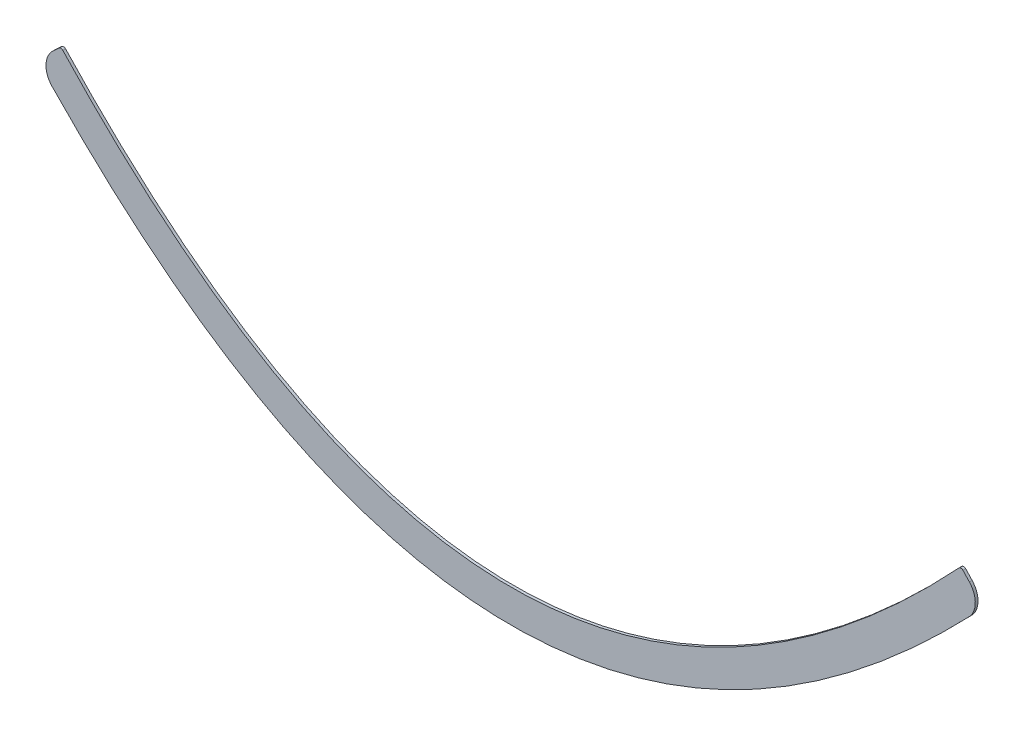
from build123d import *

# Parameters (mm, degrees)
BOSS_EXTRUDE1_DEPTH = 6.35
FILLET1_R           = 6.35
FILLET2_R           = 50.8


with BuildPart() as part:
    # Sketch1 → Boss-Extrude1 (new body)
    with BuildSketch(Plane.XY):
        with BuildLine():
            Line((50.8, -22.392105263), (-5.087388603, -74.190172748))
            add(Edge.make_bspline(
                [(-5.087388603, -74.190172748), (-2.318682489, -77.177460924), (3.238181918, -83.149684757), (14.335834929, -94.9833684), (28.221095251, -109.614438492), (44.891224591, -126.8993633), (67.13367755, -149.587882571), (94.964508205, -177.274594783), (128.408943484, -209.420308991), (161.903010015, -240.48650782), (206.631237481, -280.467236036), (262.677880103, -327.738120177), (330.171686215, -380.12112675), (397.922207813, -428.143400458), (465.946568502, -471.781311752), (557.02825402, -524.080170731), (671.622867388, -578.335298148), (810.300353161, -625.32022628), (949.935563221, -653.821301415), (1090.122883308, -663.546535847), (1230.318651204, -654.380143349), (1369.976962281, -626.431500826), (1508.686772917, -579.988786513), (1623.311029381, -526.176586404), (1714.415823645, -474.227622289), (1782.456865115, -430.850236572), (1850.22315078, -383.086915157), (1917.73164818, -330.961603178), (1973.78957422, -283.904654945), (2018.526244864, -244.094714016), (2052.026354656, -213.156451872), (2085.476548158, -181.138545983), (2113.311944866, -153.558252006), (2135.557914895, -130.9548257), (2152.230615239, -113.733698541), (2166.117963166, -99.155788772), (2177.217254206, -87.36460442), (2182.774926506, -81.413667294), (2185.544034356, -78.436984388)],
                knots=[0.488148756, 0.488148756, 0.488148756, 0.488148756, 0.488241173, 0.48833359, 0.488518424, 0.488703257, 0.488888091, 0.489257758, 0.489627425, 0.489997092, 0.49036676, 0.491106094, 0.491845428, 0.492584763, 0.493324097, 0.494063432, 0.4955421, 0.497020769, 0.498499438, 0.499978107, 0.501456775, 0.502935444, 0.504414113, 0.505892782, 0.506632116, 0.50737145, 0.508110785, 0.508850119, 0.509589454, 0.509959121, 0.510328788, 0.510698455, 0.511068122, 0.511252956, 0.51143779, 0.511622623, 0.51171504, 0.511807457, 0.511807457, 0.511807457, 0.511807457], degree=3))
            Line((2185.544034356, -78.436984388), (2133.6, -22.392105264))
            add(Edge.make_bspline(
                [(50.8, -22.392105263), (1092.2, -1146.007894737), (2133.6, -22.392105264)],
                knots=[0, 0, 0, 1, 1, 1], degree=2))
        make_face()
    extrude(amount=BOSS_EXTRUDE1_DEPTH)

    # Fillet1
    fillet1_edges = [part.edges().sort_by_distance(p)[0] for p in [
        (2133.6, -22.392105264, 3.175),
        (50.8, -22.392105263, 3.175),
    ]]
    fillet(fillet1_edges, radius=FILLET1_R)

    # Fillet2
    fillet2_edges = [part.edges().sort_by_distance(p)[0] for p in [
        (2185.544034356, -78.436984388, 3.175),
        (-5.087388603, -74.190172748, 3.175),
    ]]
    fillet(fillet2_edges, radius=FILLET2_R)


solid = part.part
